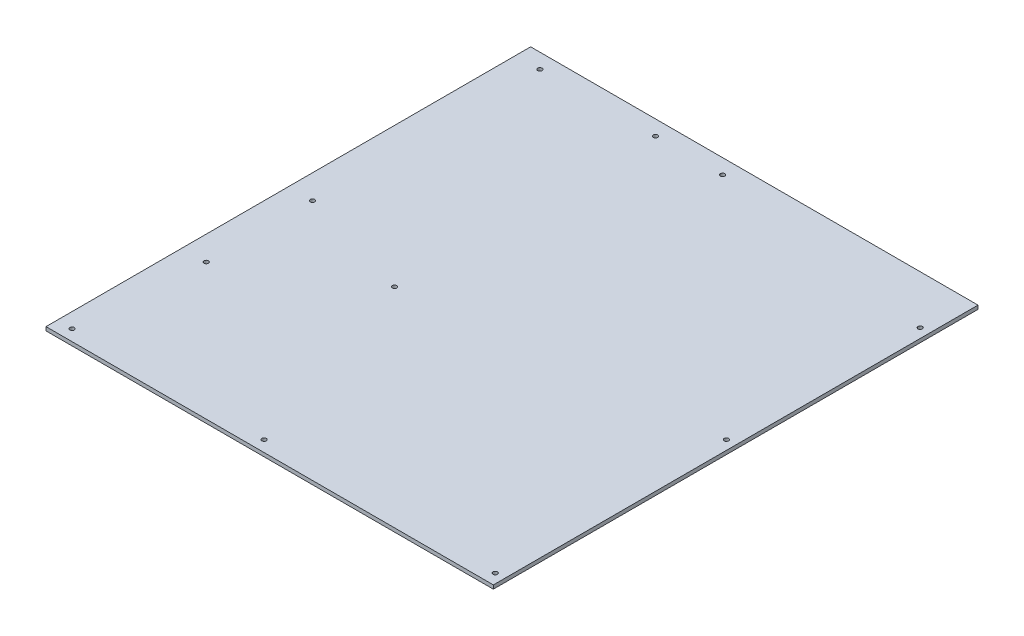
from build123d import *

# Parameters (mm, degrees)
SKETCH1_W                    = 304.8
SKETCH1_H                    = 330.2
EXTRUDE1_DEPTH               = 2.54
F_3_0_3_DIAMETER_HOLE1_D     = 3
F_3_0_3_DIAMETER_HOLE1_DEPTH = 3.048
F_3_0_3_DIAMETER_HOLE1_TIP   = 0.901290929


with BuildPart() as part:
    # Sketch1 → Extrude1 (new body)
    with BuildSketch(Plane(origin=(0, 0, 0), x_dir=(1, 0, 0), z_dir=(0, 1, 0))):
        with Locations((0, 165.1)):
            Rectangle(SKETCH1_W, SKETCH1_H)
    extrude(amount=EXTRUDE1_DEPTH)

    # 3.0 _3_ Diameter Hole1
    with Locations(Plane(origin=(0, 2.54, 0), x_dir=(1, 0, 0), z_dir=(0, 1, 0))):
        with Locations((-135.89, 320.04), (-135.89, 92.71), (-142.24, 7.62), (-57.15, 142.24), (-11.43, 320.04), (146.05, 297.18), (146.05, 165.1), (146.05, 7.62), (-57.15, 320.04), (-11.43, 7.62), (-135.89, 165.1)):
            Hole(F_3_0_3_DIAMETER_HOLE1_D / 2, depth=F_3_0_3_DIAMETER_HOLE1_DEPTH)
            with Locations((0, 0, -(F_3_0_3_DIAMETER_HOLE1_DEPTH + F_3_0_3_DIAMETER_HOLE1_TIP / 2))):  # 118° drill point
                Cone(0, F_3_0_3_DIAMETER_HOLE1_D / 2, F_3_0_3_DIAMETER_HOLE1_TIP, mode=Mode.SUBTRACT)


solid = part.part
